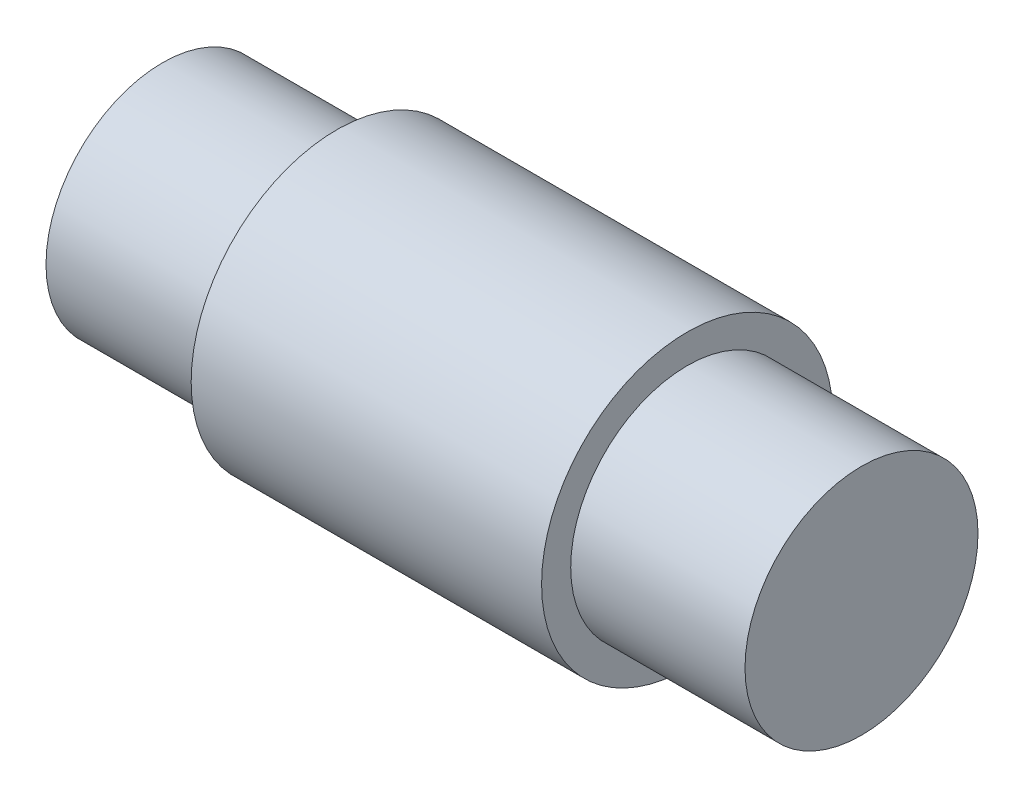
ISO-10303-21;
HEADER;
FILE_DESCRIPTION(('STEP AP214'),'2;1');
FILE_NAME('part.step','',(''),(''),'','','');
FILE_SCHEMA(('AUTOMOTIVE_DESIGN { 1 0 10303 214 1 1 1 1 }'));
ENDSEC;
DATA;
#1=APPLICATION_CONTEXT('core data for automotive mechanical design processes');
#2=APPLICATION_PROTOCOL_DEFINITION('international standard','automotive_design',2000,#1);
#3=PRODUCT_CONTEXT('',#1,'mechanical');
#4=PRODUCT('Part','Part','',(#3));
#5=PRODUCT_RELATED_PRODUCT_CATEGORY('part','',(#4));
#6=PRODUCT_DEFINITION_FORMATION('','',#4);
#7=PRODUCT_DEFINITION_CONTEXT('part definition',#1,'design');
#8=PRODUCT_DEFINITION('design','',#6,#7);
#9=PRODUCT_DEFINITION_SHAPE('','',#8);
#10=(LENGTH_UNIT() NAMED_UNIT(*) SI_UNIT(.MILLI.,.METRE.));
#11=(NAMED_UNIT(*) PLANE_ANGLE_UNIT() SI_UNIT($,.RADIAN.));
#12=(NAMED_UNIT(*) SI_UNIT($,.STERADIAN.) SOLID_ANGLE_UNIT());
#13=UNCERTAINTY_MEASURE_WITH_UNIT(LENGTH_MEASURE(1.E-05),#10,'distance_accuracy_value','');
#14=(GEOMETRIC_REPRESENTATION_CONTEXT(3) GLOBAL_UNCERTAINTY_ASSIGNED_CONTEXT((#13)) GLOBAL_UNIT_ASSIGNED_CONTEXT((#10,
#11,#12)) REPRESENTATION_CONTEXT('',''));
#15=CARTESIAN_POINT('',(0.,0.,0.));
#16=DIRECTION('',(0.,0.,1.));
#17=DIRECTION('',(1.,0.,0.));
#18=AXIS2_PLACEMENT_3D('',#15,#16,#17);
#19=CARTESIAN_POINT('',(-9.525,0.,0.));
#20=DIRECTION('',(1.,0.,0.));
#21=DIRECTION('',(0.,0.,-1.));
#22=AXIS2_PLACEMENT_3D('',#19,#20,#21);
#23=PLANE('',#22);
#24=CARTESIAN_POINT('',(-9.52500000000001,0.,0.));
#25=DIRECTION('',(-1.,0.,0.));
#26=DIRECTION('',(0.,0.,1.));
#27=AXIS2_PLACEMENT_3D('',#24,#25,#26);
#28=CIRCLE('',#27,3.175);
#29=CARTESIAN_POINT('',(-9.52500000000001,0.,3.175));
#30=VERTEX_POINT('',#29);
#31=EDGE_CURVE('E10',#30,#30,#28,.T.);
#32=ORIENTED_EDGE('',*,*,#31,.T.);
#33=EDGE_LOOP('',(#32));
#34=FACE_BOUND('',#33,.T.);
#35=ADVANCED_FACE('F41',(#34),#23,.F.);
#36=CARTESIAN_POINT('',(-76.4564887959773,0.,0.));
#37=DIRECTION('',(-1.,0.,0.));
#38=DIRECTION('',(0.,0.,1.));
#39=AXIS2_PLACEMENT_3D('',#36,#37,#38);
#40=CYLINDRICAL_SURFACE('',#39,3.175);
#41=ORIENTED_EDGE('',*,*,#31,.F.);
#42=EDGE_LOOP('',(#41));
#43=FACE_BOUND('',#42,.T.);
#44=CARTESIAN_POINT('',(-4.775,0.,0.));
#45=DIRECTION('',(-1.,0.,0.));
#46=DIRECTION('',(0.,0.,1.));
#47=AXIS2_PLACEMENT_3D('',#44,#45,#46);
#48=CIRCLE('',#47,3.175);
#49=CARTESIAN_POINT('',(-4.775,0.,3.175));
#50=VERTEX_POINT('',#49);
#51=EDGE_CURVE('E47',#50,#50,#48,.T.);
#52=ORIENTED_EDGE('',*,*,#51,.T.);
#53=EDGE_LOOP('',(#52));
#54=FACE_BOUND('',#53,.T.);
#55=ADVANCED_FACE('F79',(#43,#54),#40,.T.);
#56=CARTESIAN_POINT('',(-4.775,3.175,0.));
#57=DIRECTION('',(1.,0.,0.));
#58=DIRECTION('',(0.,0.,-1.));
#59=AXIS2_PLACEMENT_3D('',#56,#57,#58);
#60=PLANE('',#59);
#61=ORIENTED_EDGE('',*,*,#51,.F.);
#62=EDGE_LOOP('',(#61));
#63=FACE_BOUND('',#62,.T.);
#64=CARTESIAN_POINT('',(-4.775,0.,0.));
#65=DIRECTION('',(-1.,0.,0.));
#66=DIRECTION('',(0.,0.,1.));
#67=AXIS2_PLACEMENT_3D('',#64,#65,#66);
#68=CIRCLE('',#67,3.96875);
#69=CARTESIAN_POINT('',(-4.775,0.,3.96875));
#70=VERTEX_POINT('',#69);
#71=EDGE_CURVE('E51',#70,#70,#68,.T.);
#72=ORIENTED_EDGE('',*,*,#71,.T.);
#73=EDGE_LOOP('',(#72));
#74=FACE_BOUND('',#73,.T.);
#75=ADVANCED_FACE('F83',(#63,#74),#60,.F.);
#76=CARTESIAN_POINT('',(-76.4564887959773,0.,0.));
#77=DIRECTION('',(-1.,0.,0.));
#78=DIRECTION('',(0.,0.,1.));
#79=AXIS2_PLACEMENT_3D('',#76,#77,#78);
#80=CYLINDRICAL_SURFACE('',#79,3.96875);
#81=ORIENTED_EDGE('',*,*,#71,.F.);
#82=EDGE_LOOP('',(#81));
#83=FACE_BOUND('',#82,.T.);
#84=CARTESIAN_POINT('',(4.775,0.,0.));
#85=DIRECTION('',(-1.,0.,0.));
#86=DIRECTION('',(0.,0.,1.));
#87=AXIS2_PLACEMENT_3D('',#84,#85,#86);
#88=CIRCLE('',#87,3.96875);
#89=CARTESIAN_POINT('',(4.775,0.,3.96875));
#90=VERTEX_POINT('',#89);
#91=EDGE_CURVE('E55',#90,#90,#88,.T.);
#92=ORIENTED_EDGE('',*,*,#91,.T.);
#93=EDGE_LOOP('',(#92));
#94=FACE_BOUND('',#93,.T.);
#95=ADVANCED_FACE('F88',(#83,#94),#80,.T.);
#96=CARTESIAN_POINT('',(4.775,3.96875,0.));
#97=DIRECTION('',(-1.,0.,0.));
#98=DIRECTION('',(0.,0.,1.));
#99=AXIS2_PLACEMENT_3D('',#96,#97,#98);
#100=PLANE('',#99);
#101=ORIENTED_EDGE('',*,*,#91,.F.);
#102=EDGE_LOOP('',(#101));
#103=FACE_BOUND('',#102,.T.);
#104=CARTESIAN_POINT('',(4.775,0.,0.));
#105=DIRECTION('',(-1.,0.,0.));
#106=DIRECTION('',(0.,0.,1.));
#107=AXIS2_PLACEMENT_3D('',#104,#105,#106);
#108=CIRCLE('',#107,3.175);
#109=CARTESIAN_POINT('',(4.775,0.,3.175));
#110=VERTEX_POINT('',#109);
#111=EDGE_CURVE('E60',#110,#110,#108,.T.);
#112=ORIENTED_EDGE('',*,*,#111,.T.);
#113=EDGE_LOOP('',(#112));
#114=FACE_BOUND('',#113,.T.);
#115=ADVANCED_FACE('F75',(#103,#114),#100,.F.);
#116=CARTESIAN_POINT('',(-76.4564887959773,0.,0.));
#117=DIRECTION('',(-1.,0.,0.));
#118=DIRECTION('',(0.,0.,1.));
#119=AXIS2_PLACEMENT_3D('',#116,#117,#118);
#120=CYLINDRICAL_SURFACE('',#119,3.175);
#121=ORIENTED_EDGE('',*,*,#111,.F.);
#122=EDGE_LOOP('',(#121));
#123=FACE_BOUND('',#122,.T.);
#124=CARTESIAN_POINT('',(9.52500000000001,0.,0.));
#125=DIRECTION('',(-1.,0.,0.));
#126=DIRECTION('',(0.,0.,1.));
#127=AXIS2_PLACEMENT_3D('',#124,#125,#126);
#128=CIRCLE('',#127,3.175);
#129=CARTESIAN_POINT('',(9.52500000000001,0.,3.175));
#130=VERTEX_POINT('',#129);
#131=EDGE_CURVE('E63',#130,#130,#128,.T.);
#132=ORIENTED_EDGE('',*,*,#131,.T.);
#133=EDGE_LOOP('',(#132));
#134=FACE_BOUND('',#133,.T.);
#135=ADVANCED_FACE('F67',(#123,#134),#120,.T.);
#136=CARTESIAN_POINT('',(9.525,3.175,0.));
#137=DIRECTION('',(-1.,0.,0.));
#138=DIRECTION('',(0.,0.,1.));
#139=AXIS2_PLACEMENT_3D('',#136,#137,#138);
#140=PLANE('',#139);
#141=ORIENTED_EDGE('',*,*,#131,.F.);
#142=EDGE_LOOP('',(#141));
#143=FACE_BOUND('',#142,.T.);
#144=ADVANCED_FACE('F69',(#143),#140,.F.);
#145=CLOSED_SHELL('',(#35,#55,#75,#95,#115,#135,#144));
#146=MANIFOLD_SOLID_BREP('B2',#145);
#147=ADVANCED_BREP_SHAPE_REPRESENTATION('',(#18,#146),#14);
#148=SHAPE_DEFINITION_REPRESENTATION(#9,#147);
ENDSEC;
END-ISO-10303-21;
